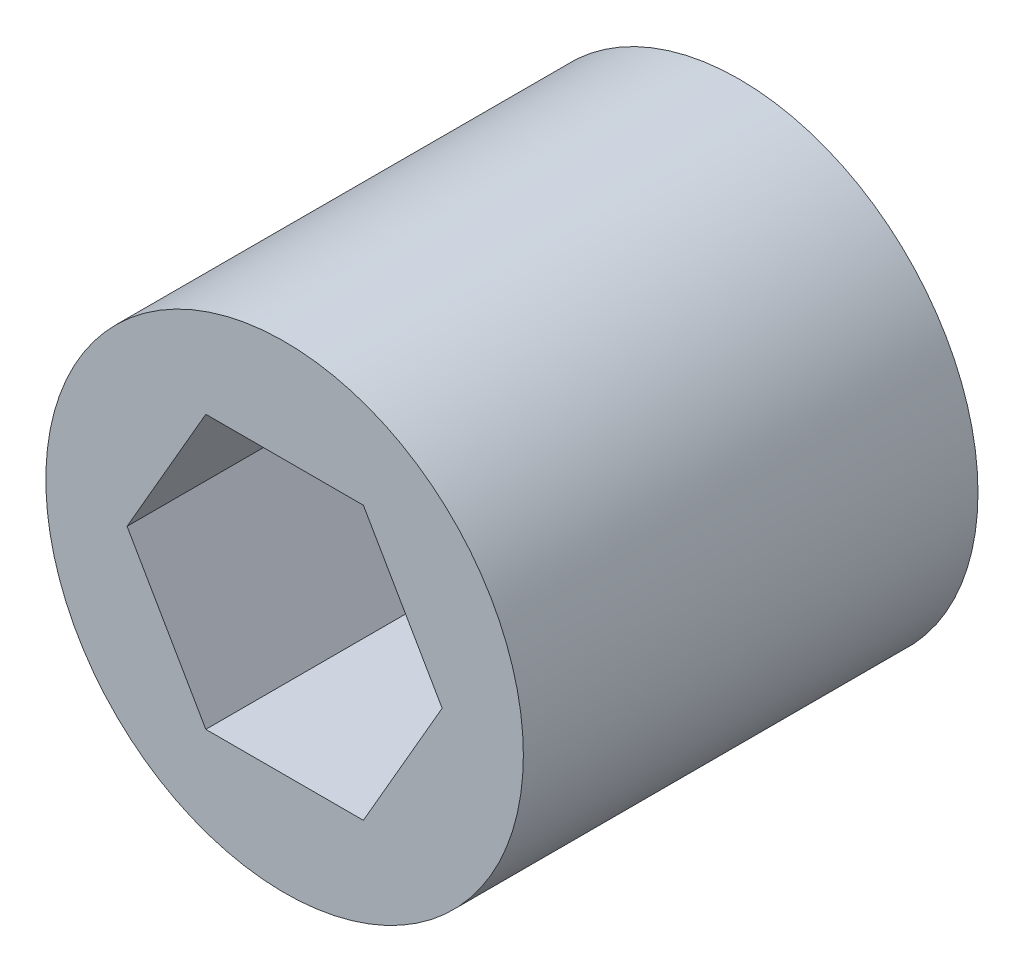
from build123d import *

# Parameters (mm, degrees)
ESQUISSE1_R         = 3.5
EXTRUSION1_DEPTH    = 4
ESQUISSE2_R         = 3.5
EXTRUSION2_DEPTH    = 4
ESQUISSE5_OUTSIDE_W = 29.514
ESQUISSE5_OUTSIDE_H = 29.514
ESQUISSE5_OUTSIDE_R = 0.5
EXTRUSION10_DEPTH   = 4
EXTRUSION10_DRAFT   = -66


with BuildPart() as part:
    # Esquisse1 → Extrusion1 (new body)
    with BuildSketch(Plane.XY):
        Circle(ESQUISSE1_R)
        Polygon((-2.309401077, 0), (-1.154700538, -2), (1.154700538, -2), (2.309401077, 0), (1.154700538, 2), (-1.154700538, 2), align=None, mode=Mode.SUBTRACT)
    extrude(amount=-EXTRUSION1_DEPTH)

    # Esquisse2 → Extrusion2 (add)
    with BuildSketch(Plane(origin=(0, 0, -4), x_dir=(-1, 0, 0), z_dir=(0, 0, -1))):
        with Locations(Location((0, 0, 0), (0, 0, 180))):
            Circle(ESQUISSE2_R)
    extrude(amount=EXTRUSION2_DEPTH)


with BuildPart() as extrusion10_tool:
    # Esquisse5 outside → Extrusion10 (with draft: the straight prism first)
    with BuildSketch(Plane(origin=(0, 0, -8), x_dir=(-1, 0, 0), z_dir=(0, 0, -1))):
        Rectangle(ESQUISSE5_OUTSIDE_W, ESQUISSE5_OUTSIDE_H)
        Circle(ESQUISSE5_OUTSIDE_R, mode=Mode.SUBTRACT)
    extrude(amount=-EXTRUSION10_DEPTH)
    # Extrusion10: the draft: its side faces are tilted about the plane it starts from
    extrusion10_sides = [extrusion10_tool.faces().sort_by_distance(p)[0] for p in [
        (0, -14.757, -6),
        (-14.757, 0, -6),
        (0, 14.757, -6),
        (14.757, 0, -6),
        (0.5, 0, -6),
    ]]
    draft(extrusion10_sides, Plane(origin=(0, 0, -8), x_dir=(-1, 0, 0), z_dir=(0, 0, -1)), EXTRUSION10_DRAFT)


with BuildPart() as part_1:
    add(part.part)

    # Extrusion10: cut by extrusion10_tool
    add(extrusion10_tool.part, mode=Mode.SUBTRACT)


solid = part_1.part
